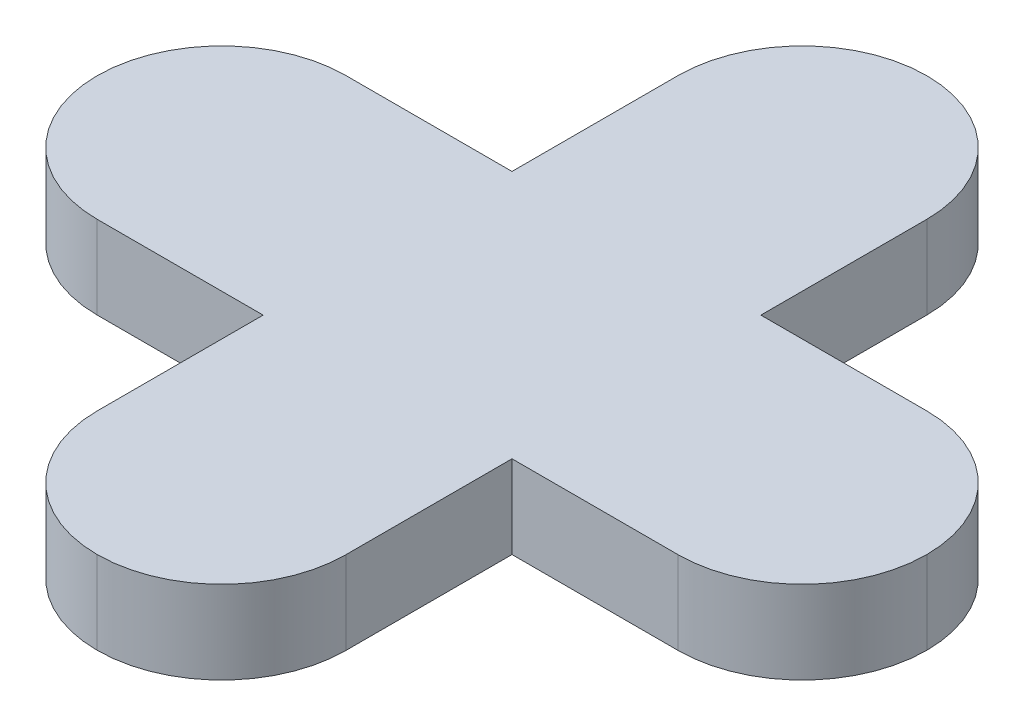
ISO-10303-21;
HEADER;
FILE_DESCRIPTION(('STEP AP214'),'2;1');
FILE_NAME('part.step','',(''),(''),'','','');
FILE_SCHEMA(('AUTOMOTIVE_DESIGN { 1 0 10303 214 1 1 1 1 }'));
ENDSEC;
DATA;
#1=APPLICATION_CONTEXT('core data for automotive mechanical design processes');
#2=APPLICATION_PROTOCOL_DEFINITION('international standard','automotive_design',2000,#1);
#3=PRODUCT_CONTEXT('',#1,'mechanical');
#4=PRODUCT('Part','Part','',(#3));
#5=PRODUCT_RELATED_PRODUCT_CATEGORY('part','',(#4));
#6=PRODUCT_DEFINITION_FORMATION('','',#4);
#7=PRODUCT_DEFINITION_CONTEXT('part definition',#1,'design');
#8=PRODUCT_DEFINITION('design','',#6,#7);
#9=PRODUCT_DEFINITION_SHAPE('','',#8);
#10=(LENGTH_UNIT() NAMED_UNIT(*) SI_UNIT(.MILLI.,.METRE.));
#11=(NAMED_UNIT(*) PLANE_ANGLE_UNIT() SI_UNIT($,.RADIAN.));
#12=(NAMED_UNIT(*) SI_UNIT($,.STERADIAN.) SOLID_ANGLE_UNIT());
#13=UNCERTAINTY_MEASURE_WITH_UNIT(LENGTH_MEASURE(1.E-05),#10,'distance_accuracy_value','');
#14=(GEOMETRIC_REPRESENTATION_CONTEXT(3) GLOBAL_UNCERTAINTY_ASSIGNED_CONTEXT((#13)) GLOBAL_UNIT_ASSIGNED_CONTEXT((#10,
#11,#12)) REPRESENTATION_CONTEXT('',''));
#15=CARTESIAN_POINT('',(0.,0.,0.));
#16=DIRECTION('',(0.,0.,1.));
#17=DIRECTION('',(1.,0.,0.));
#18=AXIS2_PLACEMENT_3D('',#15,#16,#17);
#19=CARTESIAN_POINT('',(-10.,2.,-3.));
#20=DIRECTION('',(0.,0.,1.));
#21=DIRECTION('',(1.,0.,0.));
#22=AXIS2_PLACEMENT_3D('',#19,#20,#21);
#23=PLANE('',#22);
#24=DIRECTION('',(-1.,0.,0.));
#25=VECTOR('',#24,1.);
#26=CARTESIAN_POINT('',(-10.,0.,-3.));
#27=LINE('',#26,#25);
#28=CARTESIAN_POINT('',(-3.,0.,-3.));
#29=VERTEX_POINT('',#28);
#30=CARTESIAN_POINT('',(-7.,0.,-3.));
#31=VERTEX_POINT('',#30);
#32=EDGE_CURVE('E189',#29,#31,#27,.T.);
#33=ORIENTED_EDGE('',*,*,#32,.T.);
#34=DIRECTION('',(0.,-1.,0.));
#35=VECTOR('',#34,1.);
#36=CARTESIAN_POINT('',(-7.,2.,-3.));
#37=LINE('',#36,#35);
#38=CARTESIAN_POINT('',(-7.,2.,-3.));
#39=VERTEX_POINT('',#38);
#40=EDGE_CURVE('E247',#31,#39,#37,.F.);
#41=ORIENTED_EDGE('',*,*,#40,.T.);
#42=DIRECTION('',(-1.,0.,0.));
#43=VECTOR('',#42,1.);
#44=CARTESIAN_POINT('',(-10.,2.,-3.));
#45=LINE('',#44,#43);
#46=CARTESIAN_POINT('',(-3.,2.,-3.));
#47=VERTEX_POINT('',#46);
#48=EDGE_CURVE('E157',#47,#39,#45,.T.);
#49=ORIENTED_EDGE('',*,*,#48,.F.);
#50=DIRECTION('',(0.,-1.,0.));
#51=VECTOR('',#50,1.);
#52=CARTESIAN_POINT('',(-3.,2.,-3.));
#53=LINE('',#52,#51);
#54=EDGE_CURVE('E188',#47,#29,#53,.T.);
#55=ORIENTED_EDGE('',*,*,#54,.T.);
#56=EDGE_LOOP('',(#33,#41,#49,#55));
#57=FACE_BOUND('',#56,.T.);
#58=ADVANCED_FACE('F33',(#57),#23,.F.);
#59=CARTESIAN_POINT('',(-10.,2.,3.));
#60=DIRECTION('',(0.,0.,-1.));
#61=DIRECTION('',(-1.,0.,0.));
#62=AXIS2_PLACEMENT_3D('',#59,#60,#61);
#63=PLANE('',#62);
#64=DIRECTION('',(1.,0.,0.));
#65=VECTOR('',#64,1.);
#66=CARTESIAN_POINT('',(-10.,2.,3.));
#67=LINE('',#66,#65);
#68=CARTESIAN_POINT('',(-7.,2.,3.));
#69=VERTEX_POINT('',#68);
#70=CARTESIAN_POINT('',(-3.,2.,3.));
#71=VERTEX_POINT('',#70);
#72=EDGE_CURVE('E148',#69,#71,#67,.T.);
#73=ORIENTED_EDGE('',*,*,#72,.F.);
#74=DIRECTION('',(0.,-1.,0.));
#75=VECTOR('',#74,1.);
#76=CARTESIAN_POINT('',(-7.,2.,3.));
#77=LINE('',#76,#75);
#78=CARTESIAN_POINT('',(-7.,0.,3.));
#79=VERTEX_POINT('',#78);
#80=EDGE_CURVE('E250',#69,#79,#77,.T.);
#81=ORIENTED_EDGE('',*,*,#80,.T.);
#82=DIRECTION('',(1.,0.,0.));
#83=VECTOR('',#82,1.);
#84=CARTESIAN_POINT('',(-10.,0.,3.));
#85=LINE('',#84,#83);
#86=CARTESIAN_POINT('',(-3.,0.,3.));
#87=VERTEX_POINT('',#86);
#88=EDGE_CURVE('E163',#79,#87,#85,.T.);
#89=ORIENTED_EDGE('',*,*,#88,.T.);
#90=DIRECTION('',(0.,-1.,0.));
#91=VECTOR('',#90,1.);
#92=CARTESIAN_POINT('',(-3.,2.,3.));
#93=LINE('',#92,#91);
#94=EDGE_CURVE('E160',#71,#87,#93,.T.);
#95=ORIENTED_EDGE('',*,*,#94,.F.);
#96=EDGE_LOOP('',(#73,#81,#89,#95));
#97=FACE_BOUND('',#96,.T.);
#98=ADVANCED_FACE('F161',(#97),#63,.F.);
#99=CARTESIAN_POINT('',(-3.,2.,3.));
#100=DIRECTION('',(1.,0.,0.));
#101=DIRECTION('',(0.,0.,-1.));
#102=AXIS2_PLACEMENT_3D('',#99,#100,#101);
#103=PLANE('',#102);
#104=DIRECTION('',(0.,0.,1.));
#105=VECTOR('',#104,1.);
#106=CARTESIAN_POINT('',(-3.,0.,3.));
#107=LINE('',#106,#105);
#108=CARTESIAN_POINT('',(-3.,0.,7.));
#109=VERTEX_POINT('',#108);
#110=EDGE_CURVE('E194',#87,#109,#107,.T.);
#111=ORIENTED_EDGE('',*,*,#110,.T.);
#112=DIRECTION('',(0.,-1.,0.));
#113=VECTOR('',#112,1.);
#114=CARTESIAN_POINT('',(-3.,2.,7.));
#115=LINE('',#114,#113);
#116=CARTESIAN_POINT('',(-3.,2.,7.));
#117=VERTEX_POINT('',#116);
#118=EDGE_CURVE('E173',#109,#117,#115,.F.);
#119=ORIENTED_EDGE('',*,*,#118,.T.);
#120=DIRECTION('',(0.,0.,1.));
#121=VECTOR('',#120,1.);
#122=CARTESIAN_POINT('',(-3.,2.,3.));
#123=LINE('',#122,#121);
#124=EDGE_CURVE('E152',#71,#117,#123,.T.);
#125=ORIENTED_EDGE('',*,*,#124,.F.);
#126=ORIENTED_EDGE('',*,*,#94,.T.);
#127=EDGE_LOOP('',(#111,#119,#125,#126));
#128=FACE_BOUND('',#127,.T.);
#129=ADVANCED_FACE('F171',(#128),#103,.F.);
#130=CARTESIAN_POINT('',(3.,2.,3.));
#131=DIRECTION('',(-1.,0.,0.));
#132=DIRECTION('',(0.,0.,1.));
#133=AXIS2_PLACEMENT_3D('',#130,#131,#132);
#134=PLANE('',#133);
#135=DIRECTION('',(0.,0.,-1.));
#136=VECTOR('',#135,1.);
#137=CARTESIAN_POINT('',(3.,2.,3.));
#138=LINE('',#137,#136);
#139=CARTESIAN_POINT('',(3.,2.,7.));
#140=VERTEX_POINT('',#139);
#141=CARTESIAN_POINT('',(3.,2.,3.));
#142=VERTEX_POINT('',#141);
#143=EDGE_CURVE('E174',#140,#142,#138,.T.);
#144=ORIENTED_EDGE('',*,*,#143,.F.);
#145=DIRECTION('',(0.,-1.,0.));
#146=VECTOR('',#145,1.);
#147=CARTESIAN_POINT('',(3.,2.,7.));
#148=LINE('',#147,#146);
#149=CARTESIAN_POINT('',(3.,0.,7.));
#150=VERTEX_POINT('',#149);
#151=EDGE_CURVE('E253',#140,#150,#148,.T.);
#152=ORIENTED_EDGE('',*,*,#151,.T.);
#153=DIRECTION('',(0.,0.,-1.));
#154=VECTOR('',#153,1.);
#155=CARTESIAN_POINT('',(3.,0.,3.));
#156=LINE('',#155,#154);
#157=CARTESIAN_POINT('',(3.,0.,3.));
#158=VERTEX_POINT('',#157);
#159=EDGE_CURVE('E196',#150,#158,#156,.T.);
#160=ORIENTED_EDGE('',*,*,#159,.T.);
#161=DIRECTION('',(0.,-1.,0.));
#162=VECTOR('',#161,1.);
#163=CARTESIAN_POINT('',(3.,2.,3.));
#164=LINE('',#163,#162);
#165=EDGE_CURVE('E168',#142,#158,#164,.T.);
#166=ORIENTED_EDGE('',*,*,#165,.F.);
#167=EDGE_LOOP('',(#144,#152,#160,#166));
#168=FACE_BOUND('',#167,.T.);
#169=ADVANCED_FACE('F288',(#168),#134,.F.);
#170=CARTESIAN_POINT('',(10.,2.,3.));
#171=DIRECTION('',(0.,0.,-1.));
#172=DIRECTION('',(-1.,0.,0.));
#173=AXIS2_PLACEMENT_3D('',#170,#171,#172);
#174=PLANE('',#173);
#175=DIRECTION('',(1.,0.,0.));
#176=VECTOR('',#175,1.);
#177=CARTESIAN_POINT('',(10.,0.,3.));
#178=LINE('',#177,#176);
#179=CARTESIAN_POINT('',(7.,0.,3.));
#180=VERTEX_POINT('',#179);
#181=EDGE_CURVE('E198',#158,#180,#178,.T.);
#182=ORIENTED_EDGE('',*,*,#181,.T.);
#183=DIRECTION('',(0.,-1.,0.));
#184=VECTOR('',#183,1.);
#185=CARTESIAN_POINT('',(7.,2.,3.));
#186=LINE('',#185,#184);
#187=CARTESIAN_POINT('',(7.,2.,3.));
#188=VERTEX_POINT('',#187);
#189=EDGE_CURVE('E11',#180,#188,#186,.F.);
#190=ORIENTED_EDGE('',*,*,#189,.T.);
#191=DIRECTION('',(1.,0.,0.));
#192=VECTOR('',#191,1.);
#193=CARTESIAN_POINT('',(10.,2.,3.));
#194=LINE('',#193,#192);
#195=EDGE_CURVE('E176',#142,#188,#194,.T.);
#196=ORIENTED_EDGE('',*,*,#195,.F.);
#197=ORIENTED_EDGE('',*,*,#165,.T.);
#198=EDGE_LOOP('',(#182,#190,#196,#197));
#199=FACE_BOUND('',#198,.T.);
#200=ADVANCED_FACE('F283',(#199),#174,.F.);
#201=CARTESIAN_POINT('',(10.,2.,-3.));
#202=DIRECTION('',(0.,0.,1.));
#203=DIRECTION('',(1.,0.,0.));
#204=AXIS2_PLACEMENT_3D('',#201,#202,#203);
#205=PLANE('',#204);
#206=DIRECTION('',(-1.,0.,0.));
#207=VECTOR('',#206,1.);
#208=CARTESIAN_POINT('',(10.,2.,-3.));
#209=LINE('',#208,#207);
#210=CARTESIAN_POINT('',(7.,2.,-3.));
#211=VERTEX_POINT('',#210);
#212=CARTESIAN_POINT('',(3.,2.,-3.));
#213=VERTEX_POINT('',#212);
#214=EDGE_CURVE('E182',#211,#213,#209,.T.);
#215=ORIENTED_EDGE('',*,*,#214,.F.);
#216=DIRECTION('',(0.,-1.,0.));
#217=VECTOR('',#216,1.);
#218=CARTESIAN_POINT('',(7.,2.,-3.));
#219=LINE('',#218,#217);
#220=CARTESIAN_POINT('',(7.,0.,-3.));
#221=VERTEX_POINT('',#220);
#222=EDGE_CURVE('E42',#211,#221,#219,.T.);
#223=ORIENTED_EDGE('',*,*,#222,.T.);
#224=DIRECTION('',(-1.,0.,0.));
#225=VECTOR('',#224,1.);
#226=CARTESIAN_POINT('',(10.,0.,-3.));
#227=LINE('',#226,#225);
#228=CARTESIAN_POINT('',(3.,0.,-3.));
#229=VERTEX_POINT('',#228);
#230=EDGE_CURVE('E201',#221,#229,#227,.T.);
#231=ORIENTED_EDGE('',*,*,#230,.T.);
#232=DIRECTION('',(0.,-1.,0.));
#233=VECTOR('',#232,1.);
#234=CARTESIAN_POINT('',(3.,2.,-3.));
#235=LINE('',#234,#233);
#236=EDGE_CURVE('E209',#213,#229,#235,.T.);
#237=ORIENTED_EDGE('',*,*,#236,.F.);
#238=EDGE_LOOP('',(#215,#223,#231,#237));
#239=FACE_BOUND('',#238,.T.);
#240=ADVANCED_FACE('F340',(#239),#205,.F.);
#241=CARTESIAN_POINT('',(3.,2.,-3.));
#242=DIRECTION('',(-1.,0.,0.));
#243=DIRECTION('',(0.,0.,1.));
#244=AXIS2_PLACEMENT_3D('',#241,#242,#243);
#245=PLANE('',#244);
#246=DIRECTION('',(0.,0.,-1.));
#247=VECTOR('',#246,1.);
#248=CARTESIAN_POINT('',(3.,0.,-3.));
#249=LINE('',#248,#247);
#250=CARTESIAN_POINT('',(3.,0.,-7.));
#251=VERTEX_POINT('',#250);
#252=EDGE_CURVE('E203',#229,#251,#249,.T.);
#253=ORIENTED_EDGE('',*,*,#252,.T.);
#254=DIRECTION('',(0.,-1.,0.));
#255=VECTOR('',#254,1.);
#256=CARTESIAN_POINT('',(3.,2.,-7.));
#257=LINE('',#256,#255);
#258=CARTESIAN_POINT('',(3.,2.,-7.));
#259=VERTEX_POINT('',#258);
#260=EDGE_CURVE('E58',#251,#259,#257,.F.);
#261=ORIENTED_EDGE('',*,*,#260,.T.);
#262=DIRECTION('',(0.,0.,-1.));
#263=VECTOR('',#262,1.);
#264=CARTESIAN_POINT('',(3.,2.,-3.));
#265=LINE('',#264,#263);
#266=EDGE_CURVE('E184',#213,#259,#265,.T.);
#267=ORIENTED_EDGE('',*,*,#266,.F.);
#268=ORIENTED_EDGE('',*,*,#236,.T.);
#269=EDGE_LOOP('',(#253,#261,#267,#268));
#270=FACE_BOUND('',#269,.T.);
#271=ADVANCED_FACE('F343',(#270),#245,.F.);
#272=CARTESIAN_POINT('',(-3.,2.,-3.));
#273=DIRECTION('',(1.,0.,0.));
#274=DIRECTION('',(0.,0.,-1.));
#275=AXIS2_PLACEMENT_3D('',#272,#273,#274);
#276=PLANE('',#275);
#277=DIRECTION('',(0.,0.,1.));
#278=VECTOR('',#277,1.);
#279=CARTESIAN_POINT('',(-3.,2.,-3.));
#280=LINE('',#279,#278);
#281=CARTESIAN_POINT('',(-3.,2.,-7.));
#282=VERTEX_POINT('',#281);
#283=EDGE_CURVE('E186',#282,#47,#280,.T.);
#284=ORIENTED_EDGE('',*,*,#283,.F.);
#285=DIRECTION('',(0.,-1.,0.));
#286=VECTOR('',#285,1.);
#287=CARTESIAN_POINT('',(-3.,2.,-7.));
#288=LINE('',#287,#286);
#289=CARTESIAN_POINT('',(-3.,0.,-7.));
#290=VERTEX_POINT('',#289);
#291=EDGE_CURVE('E167',#282,#290,#288,.T.);
#292=ORIENTED_EDGE('',*,*,#291,.T.);
#293=DIRECTION('',(0.,0.,1.));
#294=VECTOR('',#293,1.);
#295=CARTESIAN_POINT('',(-3.,0.,-3.));
#296=LINE('',#295,#294);
#297=EDGE_CURVE('E205',#290,#29,#296,.T.);
#298=ORIENTED_EDGE('',*,*,#297,.T.);
#299=ORIENTED_EDGE('',*,*,#54,.F.);
#300=EDGE_LOOP('',(#284,#292,#298,#299));
#301=FACE_BOUND('',#300,.T.);
#302=ADVANCED_FACE('F310',(#301),#276,.F.);
#303=CARTESIAN_POINT('',(0.,2.,0.));
#304=DIRECTION('',(0.,1.,0.));
#305=DIRECTION('',(0.,0.,1.));
#306=AXIS2_PLACEMENT_3D('',#303,#304,#305);
#307=PLANE('',#306);
#308=CARTESIAN_POINT('',(0.,2.,-7.));
#309=DIRECTION('',(0.,1.,0.));
#310=DIRECTION('',(0.,0.,1.));
#311=AXIS2_PLACEMENT_3D('',#308,#309,#310);
#312=CIRCLE('',#311,3.);
#313=CARTESIAN_POINT('',(0.,2.,-10.));
#314=VERTEX_POINT('',#313);
#315=EDGE_CURVE('E50',#259,#314,#312,.T.);
#316=ORIENTED_EDGE('',*,*,#315,.T.);
#317=CARTESIAN_POINT('',(0.,2.,-7.));
#318=DIRECTION('',(0.,1.,0.));
#319=DIRECTION('',(0.,0.,1.));
#320=AXIS2_PLACEMENT_3D('',#317,#318,#319);
#321=CIRCLE('',#320,3.);
#322=EDGE_CURVE('E244',#314,#282,#321,.T.);
#323=ORIENTED_EDGE('',*,*,#322,.T.);
#324=ORIENTED_EDGE('',*,*,#283,.T.);
#325=ORIENTED_EDGE('',*,*,#48,.T.);
#326=CARTESIAN_POINT('',(-7.,2.,0.));
#327=DIRECTION('',(0.,1.,0.));
#328=DIRECTION('',(0.,0.,1.));
#329=AXIS2_PLACEMENT_3D('',#326,#327,#328);
#330=CIRCLE('',#329,3.);
#331=CARTESIAN_POINT('',(-10.,2.,0.));
#332=VERTEX_POINT('',#331);
#333=EDGE_CURVE('E241',#39,#332,#330,.T.);
#334=ORIENTED_EDGE('',*,*,#333,.T.);
#335=CARTESIAN_POINT('',(-7.,2.,0.));
#336=DIRECTION('',(0.,1.,0.));
#337=DIRECTION('',(0.,0.,1.));
#338=AXIS2_PLACEMENT_3D('',#335,#336,#337);
#339=CIRCLE('',#338,3.);
#340=EDGE_CURVE('E154',#332,#69,#339,.T.);
#341=ORIENTED_EDGE('',*,*,#340,.T.);
#342=ORIENTED_EDGE('',*,*,#72,.T.);
#343=ORIENTED_EDGE('',*,*,#124,.T.);
#344=CARTESIAN_POINT('',(0.,2.,7.));
#345=DIRECTION('',(0.,1.,0.));
#346=DIRECTION('',(0.,0.,1.));
#347=AXIS2_PLACEMENT_3D('',#344,#345,#346);
#348=CIRCLE('',#347,3.);
#349=CARTESIAN_POINT('',(0.,2.,10.));
#350=VERTEX_POINT('',#349);
#351=EDGE_CURVE('E238',#117,#350,#348,.T.);
#352=ORIENTED_EDGE('',*,*,#351,.T.);
#353=CARTESIAN_POINT('',(0.,2.,7.));
#354=DIRECTION('',(0.,1.,0.));
#355=DIRECTION('',(0.,0.,1.));
#356=AXIS2_PLACEMENT_3D('',#353,#354,#355);
#357=CIRCLE('',#356,3.);
#358=EDGE_CURVE('E236',#350,#140,#357,.T.);
#359=ORIENTED_EDGE('',*,*,#358,.T.);
#360=ORIENTED_EDGE('',*,*,#143,.T.);
#361=ORIENTED_EDGE('',*,*,#195,.T.);
#362=CARTESIAN_POINT('',(7.,2.,0.));
#363=DIRECTION('',(0.,1.,0.));
#364=DIRECTION('',(0.,0.,1.));
#365=AXIS2_PLACEMENT_3D('',#362,#363,#364);
#366=CIRCLE('',#365,3.);
#367=CARTESIAN_POINT('',(10.,2.,0.));
#368=VERTEX_POINT('',#367);
#369=EDGE_CURVE('E232',#188,#368,#366,.T.);
#370=ORIENTED_EDGE('',*,*,#369,.T.);
#371=CARTESIAN_POINT('',(7.,2.,0.));
#372=DIRECTION('',(0.,1.,0.));
#373=DIRECTION('',(0.,0.,1.));
#374=AXIS2_PLACEMENT_3D('',#371,#372,#373);
#375=CIRCLE('',#374,3.);
#376=EDGE_CURVE('E234',#368,#211,#375,.T.);
#377=ORIENTED_EDGE('',*,*,#376,.T.);
#378=ORIENTED_EDGE('',*,*,#214,.T.);
#379=ORIENTED_EDGE('',*,*,#266,.T.);
#380=EDGE_LOOP('',(#316,#323,#324,#325,#334,#341,#342,#343,#352,#359,#360,#361,#370,#377,#378,#379));
#381=FACE_BOUND('',#380,.T.);
#382=ADVANCED_FACE('F150',(#381),#307,.T.);
#383=CARTESIAN_POINT('',(0.,0.,0.));
#384=DIRECTION('',(0.,1.,0.));
#385=DIRECTION('',(0.,0.,1.));
#386=AXIS2_PLACEMENT_3D('',#383,#384,#385);
#387=PLANE('',#386);
#388=ORIENTED_EDGE('',*,*,#297,.F.);
#389=CARTESIAN_POINT('',(0.,0.,-7.));
#390=DIRECTION('',(0.,1.,0.));
#391=DIRECTION('',(0.,0.,1.));
#392=AXIS2_PLACEMENT_3D('',#389,#390,#391);
#393=CIRCLE('',#392,3.);
#394=CARTESIAN_POINT('',(0.,0.,-10.));
#395=VERTEX_POINT('',#394);
#396=EDGE_CURVE('E230',#290,#395,#393,.F.);
#397=ORIENTED_EDGE('',*,*,#396,.T.);
#398=CARTESIAN_POINT('',(0.,0.,-7.));
#399=DIRECTION('',(0.,1.,0.));
#400=DIRECTION('',(0.,0.,1.));
#401=AXIS2_PLACEMENT_3D('',#398,#399,#400);
#402=CIRCLE('',#401,3.);
#403=EDGE_CURVE('E228',#395,#251,#402,.F.);
#404=ORIENTED_EDGE('',*,*,#403,.T.);
#405=ORIENTED_EDGE('',*,*,#252,.F.);
#406=ORIENTED_EDGE('',*,*,#230,.F.);
#407=CARTESIAN_POINT('',(7.,0.,0.));
#408=DIRECTION('',(0.,1.,0.));
#409=DIRECTION('',(0.,0.,1.));
#410=AXIS2_PLACEMENT_3D('',#407,#408,#409);
#411=CIRCLE('',#410,3.);
#412=CARTESIAN_POINT('',(10.,0.,0.));
#413=VERTEX_POINT('',#412);
#414=EDGE_CURVE('E218',#221,#413,#411,.F.);
#415=ORIENTED_EDGE('',*,*,#414,.T.);
#416=CARTESIAN_POINT('',(7.,0.,0.));
#417=DIRECTION('',(0.,1.,0.));
#418=DIRECTION('',(0.,0.,1.));
#419=AXIS2_PLACEMENT_3D('',#416,#417,#418);
#420=CIRCLE('',#419,3.);
#421=EDGE_CURVE('E216',#413,#180,#420,.F.);
#422=ORIENTED_EDGE('',*,*,#421,.T.);
#423=ORIENTED_EDGE('',*,*,#181,.F.);
#424=ORIENTED_EDGE('',*,*,#159,.F.);
#425=CARTESIAN_POINT('',(0.,0.,7.));
#426=DIRECTION('',(0.,1.,0.));
#427=DIRECTION('',(0.,0.,1.));
#428=AXIS2_PLACEMENT_3D('',#425,#426,#427);
#429=CIRCLE('',#428,3.);
#430=CARTESIAN_POINT('',(0.,0.,10.));
#431=VERTEX_POINT('',#430);
#432=EDGE_CURVE('E220',#150,#431,#429,.F.);
#433=ORIENTED_EDGE('',*,*,#432,.T.);
#434=CARTESIAN_POINT('',(0.,0.,7.));
#435=DIRECTION('',(0.,1.,0.));
#436=DIRECTION('',(0.,0.,1.));
#437=AXIS2_PLACEMENT_3D('',#434,#435,#436);
#438=CIRCLE('',#437,3.);
#439=EDGE_CURVE('E222',#431,#109,#438,.F.);
#440=ORIENTED_EDGE('',*,*,#439,.T.);
#441=ORIENTED_EDGE('',*,*,#110,.F.);
#442=ORIENTED_EDGE('',*,*,#88,.F.);
#443=CARTESIAN_POINT('',(-7.,0.,0.));
#444=DIRECTION('',(0.,1.,0.));
#445=DIRECTION('',(0.,0.,1.));
#446=AXIS2_PLACEMENT_3D('',#443,#444,#445);
#447=CIRCLE('',#446,3.);
#448=CARTESIAN_POINT('',(-10.,0.,0.));
#449=VERTEX_POINT('',#448);
#450=EDGE_CURVE('E224',#79,#449,#447,.F.);
#451=ORIENTED_EDGE('',*,*,#450,.T.);
#452=CARTESIAN_POINT('',(-7.,0.,0.));
#453=DIRECTION('',(0.,1.,0.));
#454=DIRECTION('',(0.,0.,1.));
#455=AXIS2_PLACEMENT_3D('',#452,#453,#454);
#456=CIRCLE('',#455,3.);
#457=EDGE_CURVE('E226',#449,#31,#456,.F.);
#458=ORIENTED_EDGE('',*,*,#457,.T.);
#459=ORIENTED_EDGE('',*,*,#32,.F.);
#460=EDGE_LOOP('',(#388,#397,#404,#405,#406,#415,#422,#423,#424,#433,#440,#441,#442,#451,#458,#459));
#461=FACE_BOUND('',#460,.T.);
#462=ADVANCED_FACE('F279',(#461),#387,.F.);
#463=CARTESIAN_POINT('',(0.,2.,-7.));
#464=DIRECTION('',(0.,-1.,0.));
#465=DIRECTION('',(0.,0.,-1.));
#466=AXIS2_PLACEMENT_3D('',#463,#464,#465);
#467=CYLINDRICAL_SURFACE('',#466,3.);
#468=DIRECTION('',(0.,-1.,0.));
#469=VECTOR('',#468,1.);
#470=CARTESIAN_POINT('',(0.,2.,-10.));
#471=LINE('',#470,#469);
#472=EDGE_CURVE('E192',#314,#395,#471,.T.);
#473=ORIENTED_EDGE('',*,*,#472,.F.);
#474=ORIENTED_EDGE('',*,*,#315,.F.);
#475=ORIENTED_EDGE('',*,*,#260,.F.);
#476=ORIENTED_EDGE('',*,*,#403,.F.);
#477=EDGE_LOOP('',(#473,#474,#475,#476));
#478=FACE_BOUND('',#477,.T.);
#479=ADVANCED_FACE('F316',(#478),#467,.T.);
#480=CARTESIAN_POINT('',(0.,2.,-7.));
#481=DIRECTION('',(0.,-1.,0.));
#482=DIRECTION('',(0.,0.,-1.));
#483=AXIS2_PLACEMENT_3D('',#480,#481,#482);
#484=CYLINDRICAL_SURFACE('',#483,3.);
#485=ORIENTED_EDGE('',*,*,#322,.F.);
#486=ORIENTED_EDGE('',*,*,#472,.T.);
#487=ORIENTED_EDGE('',*,*,#396,.F.);
#488=ORIENTED_EDGE('',*,*,#291,.F.);
#489=EDGE_LOOP('',(#485,#486,#487,#488));
#490=FACE_BOUND('',#489,.T.);
#491=ADVANCED_FACE('F318',(#490),#484,.T.);
#492=CARTESIAN_POINT('',(-7.,2.,0.));
#493=DIRECTION('',(0.,-1.,0.));
#494=DIRECTION('',(0.,0.,-1.));
#495=AXIS2_PLACEMENT_3D('',#492,#493,#494);
#496=CYLINDRICAL_SURFACE('',#495,3.);
#497=ORIENTED_EDGE('',*,*,#80,.F.);
#498=ORIENTED_EDGE('',*,*,#340,.F.);
#499=DIRECTION('',(0.,-1.,0.));
#500=VECTOR('',#499,1.);
#501=CARTESIAN_POINT('',(-10.,2.,0.));
#502=LINE('',#501,#500);
#503=EDGE_CURVE('E259',#449,#332,#502,.F.);
#504=ORIENTED_EDGE('',*,*,#503,.F.);
#505=ORIENTED_EDGE('',*,*,#450,.F.);
#506=EDGE_LOOP('',(#497,#498,#504,#505));
#507=FACE_BOUND('',#506,.T.);
#508=ADVANCED_FACE('F298',(#507),#496,.T.);
#509=CARTESIAN_POINT('',(-7.,2.,0.));
#510=DIRECTION('',(0.,-1.,0.));
#511=DIRECTION('',(0.,0.,-1.));
#512=AXIS2_PLACEMENT_3D('',#509,#510,#511);
#513=CYLINDRICAL_SURFACE('',#512,3.);
#514=ORIENTED_EDGE('',*,*,#333,.F.);
#515=ORIENTED_EDGE('',*,*,#40,.F.);
#516=ORIENTED_EDGE('',*,*,#457,.F.);
#517=ORIENTED_EDGE('',*,*,#503,.T.);
#518=EDGE_LOOP('',(#514,#515,#516,#517));
#519=FACE_BOUND('',#518,.T.);
#520=ADVANCED_FACE('F302',(#519),#513,.T.);
#521=CARTESIAN_POINT('',(0.,2.,7.));
#522=DIRECTION('',(0.,-1.,0.));
#523=DIRECTION('',(0.,0.,-1.));
#524=AXIS2_PLACEMENT_3D('',#521,#522,#523);
#525=CYLINDRICAL_SURFACE('',#524,3.);
#526=ORIENTED_EDGE('',*,*,#151,.F.);
#527=ORIENTED_EDGE('',*,*,#358,.F.);
#528=DIRECTION('',(0.,-1.,0.));
#529=VECTOR('',#528,1.);
#530=CARTESIAN_POINT('',(0.,2.,10.));
#531=LINE('',#530,#529);
#532=EDGE_CURVE('E261',#431,#350,#531,.F.);
#533=ORIENTED_EDGE('',*,*,#532,.F.);
#534=ORIENTED_EDGE('',*,*,#432,.F.);
#535=EDGE_LOOP('',(#526,#527,#533,#534));
#536=FACE_BOUND('',#535,.T.);
#537=ADVANCED_FACE('F292',(#536),#525,.T.);
#538=CARTESIAN_POINT('',(0.,2.,7.));
#539=DIRECTION('',(0.,-1.,0.));
#540=DIRECTION('',(0.,0.,-1.));
#541=AXIS2_PLACEMENT_3D('',#538,#539,#540);
#542=CYLINDRICAL_SURFACE('',#541,3.);
#543=ORIENTED_EDGE('',*,*,#351,.F.);
#544=ORIENTED_EDGE('',*,*,#118,.F.);
#545=ORIENTED_EDGE('',*,*,#439,.F.);
#546=ORIENTED_EDGE('',*,*,#532,.T.);
#547=EDGE_LOOP('',(#543,#544,#545,#546));
#548=FACE_BOUND('',#547,.T.);
#549=ADVANCED_FACE('F294',(#548),#542,.T.);
#550=CARTESIAN_POINT('',(7.,2.,0.));
#551=DIRECTION('',(0.,-1.,0.));
#552=DIRECTION('',(0.,0.,-1.));
#553=AXIS2_PLACEMENT_3D('',#550,#551,#552);
#554=CYLINDRICAL_SURFACE('',#553,3.);
#555=DIRECTION('',(0.,-1.,0.));
#556=VECTOR('',#555,1.);
#557=CARTESIAN_POINT('',(10.,2.,0.));
#558=LINE('',#557,#556);
#559=EDGE_CURVE('E37',#368,#413,#558,.T.);
#560=ORIENTED_EDGE('',*,*,#559,.F.);
#561=ORIENTED_EDGE('',*,*,#369,.F.);
#562=ORIENTED_EDGE('',*,*,#189,.F.);
#563=ORIENTED_EDGE('',*,*,#421,.F.);
#564=EDGE_LOOP('',(#560,#561,#562,#563));
#565=FACE_BOUND('',#564,.T.);
#566=ADVANCED_FACE('F35',(#565),#554,.T.);
#567=CARTESIAN_POINT('',(7.,2.,0.));
#568=DIRECTION('',(0.,-1.,0.));
#569=DIRECTION('',(0.,0.,-1.));
#570=AXIS2_PLACEMENT_3D('',#567,#568,#569);
#571=CYLINDRICAL_SURFACE('',#570,3.);
#572=ORIENTED_EDGE('',*,*,#376,.F.);
#573=ORIENTED_EDGE('',*,*,#559,.T.);
#574=ORIENTED_EDGE('',*,*,#414,.F.);
#575=ORIENTED_EDGE('',*,*,#222,.F.);
#576=EDGE_LOOP('',(#572,#573,#574,#575));
#577=FACE_BOUND('',#576,.T.);
#578=ADVANCED_FACE('F270',(#577),#571,.T.);
#579=CLOSED_SHELL('',(#58,#98,#129,#169,#200,#240,#271,#302,#382,#462,#479,#491,#508,#520,#537,
#549,#566,#578));
#580=MANIFOLD_SOLID_BREP('B2',#579);
#581=ADVANCED_BREP_SHAPE_REPRESENTATION('',(#18,#580),#14);
#582=SHAPE_DEFINITION_REPRESENTATION(#9,#581);
ENDSEC;
END-ISO-10303-21;
